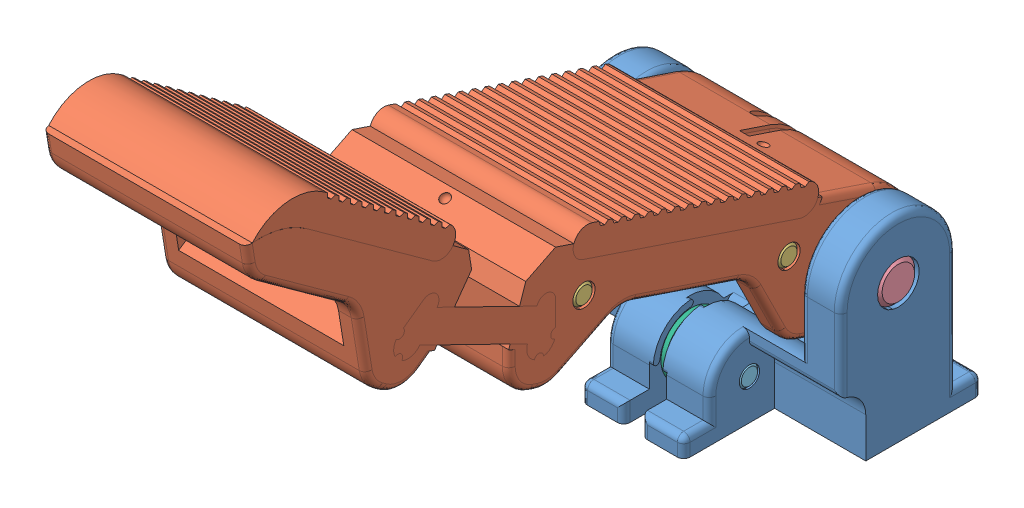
SolidWorks assembly Assem2.sldasm, configuration Default (file format 5000). Lengths in mm.
Overall size (44.45 76.27 119.2).
7 component instances, 6 part files, 12 mates.
Components (placement in the parent):
- c1-1: c1.SLDPRT [Default] at origin size (44.45 30.5 32.25)
- finger_pivot-1: finger_pivot.SLDPRT [Default] at (0.15 21.5 -9) x (-1 0 0) z (0 -0.318459 -0.947937) size (31.75 31.06 115.31)
- 98381A477-1: 98381A477.SLDPRT [98381A477] at (0.15 38.1713 33.8338) size (31.75 3.17 3.17)
- 98381A477-2: 98381A477.SLDPRT [98381A477] at (0.15 27.4271 1.8525) size (31.75 3.17 3.17)
- 98381A548-1: 98381A548.SLDPRT [98381A548] at (0 21.5 -9) size (44.45 6.35 6.35)
- 97395A445-1: 97395A445.SLDPRT [97395A445] at (0.0625 6.25 0) size (15.88 3.17 3.17)
- pulley-1: pulley.SLDPRT [Default] at (0.15 6.25 0) x (0 -1 0) z (0 0 1) size (9.5 2.4 9.5)
Mates (geometry in assembly coordinates):
- Concentric1: concentric aligned: cylinder of c1-1 through (22.225 21.5 -9) axis (-1 0 0) radius 3.25; cylinder of finger_pivot-1 through (16.025 21.5 -9) axis (-1 0 0) radius 3.475
- Coincident1: coincident anti-aligned: plane of c1-1 through (16.025 6.25 0) normal (-1 0 0); plane of finger_pivot-1 through (16.025 21.5 -9) normal (1 0 0)
- Concentric2: concentric anti-aligned: cylinder of c1-1 through (22.225 21.5 -9) axis (-1 0 0) radius 3.25; cylinder of 98381A548-1 through (-22.225 21.5 -9) axis (1 0 0) radius 3.175
- Coincident2: coincident aligned: plane of c1-1 through (22.225 6.25 0) normal (1 0 0); plane of 98381A548-1 through (22.225 21.5 -9) normal (1 0 0)
- Concentric3: concentric anti-aligned: cylinder of finger_pivot-1 through (16.025 27.4271 1.8525) axis (-1 0 0) radius 1.7375; cylinder of 98381A477-2 through (-15.725 27.4271 1.8525) axis (1 0 0) radius 1.5875
- Concentric4: concentric anti-aligned: cylinder of finger_pivot-1 through (16.025 38.1713 33.8338) axis (-1 0 0) radius 1.7375; cylinder of 98381A477-1 through (-15.725 38.1713 33.8338) axis (1 0 0) radius 1.5875
- Coincident3: coincident aligned: plane of finger_pivot-1 through (16.025 21.5 -9) normal (1 0 0); plane of 98381A477-1 through (16.025 38.1713 33.8338) normal (1 0 0)
- Coincident4: coincident aligned: plane of finger_pivot-1 through (16.025 21.5 -9) normal (1 0 0); plane of 98381A477-2 through (16.025 27.4271 1.8525) normal (1 0 0)
- Concentric5: concentric anti-aligned: cylinder of c1-1 through (22.225 6.25 0) axis (-1 0 0) radius 1.5875; cylinder of 97395A445-1 through (-7.875 6.25 0) axis (1 0 0) radius 1.5875
- Coincident5: coincident aligned: plane of c1-1 through (8 6.25 0) normal (1 0 0); plane of 97395A445-1 through (8 6.25 0) normal (1 0 0)
- Concentric6: concentric anti-aligned: cylinder of 97395A445-1 through (-7.875 6.25 0) axis (1 0 0) radius 1.5875; cylinder of pulley-1 through (0.15 6.25 0) axis (-1 0 0) radius 1.5
- Coincident6: coincident anti-aligned: plane of c1-1 through (1.35 6.25 0) normal (-1 0 0); plane of pulley-1 through (1.35 4.75 0) normal (1 0 0)
